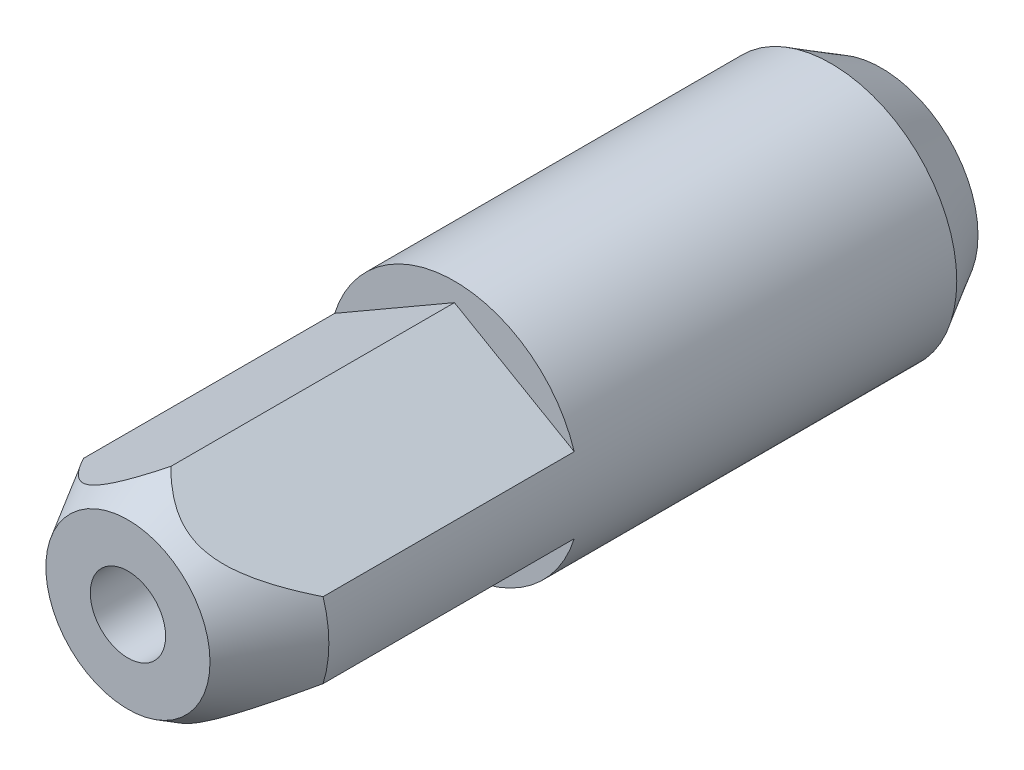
ISO-10303-21;
HEADER;
FILE_DESCRIPTION(('STEP AP214'),'2;1');
FILE_NAME('part.step','',(''),(''),'','','');
FILE_SCHEMA(('AUTOMOTIVE_DESIGN { 1 0 10303 214 1 1 1 1 }'));
ENDSEC;
DATA;
#1=APPLICATION_CONTEXT('core data for automotive mechanical design processes');
#2=APPLICATION_PROTOCOL_DEFINITION('international standard','automotive_design',2000,#1);
#3=PRODUCT_CONTEXT('',#1,'mechanical');
#4=PRODUCT('Part','Part','',(#3));
#5=PRODUCT_RELATED_PRODUCT_CATEGORY('part','',(#4));
#6=PRODUCT_DEFINITION_FORMATION('','',#4);
#7=PRODUCT_DEFINITION_CONTEXT('part definition',#1,'design');
#8=PRODUCT_DEFINITION('design','',#6,#7);
#9=PRODUCT_DEFINITION_SHAPE('','',#8);
#10=(LENGTH_UNIT() NAMED_UNIT(*) SI_UNIT(.MILLI.,.METRE.));
#11=(NAMED_UNIT(*) PLANE_ANGLE_UNIT() SI_UNIT($,.RADIAN.));
#12=(NAMED_UNIT(*) SI_UNIT($,.STERADIAN.) SOLID_ANGLE_UNIT());
#13=UNCERTAINTY_MEASURE_WITH_UNIT(LENGTH_MEASURE(1.E-05),#10,'distance_accuracy_value','');
#14=(GEOMETRIC_REPRESENTATION_CONTEXT(3) GLOBAL_UNCERTAINTY_ASSIGNED_CONTEXT((#13)) GLOBAL_UNIT_ASSIGNED_CONTEXT((#10,
#11,#12)) REPRESENTATION_CONTEXT('',''));
#15=CARTESIAN_POINT('',(0.,0.,0.));
#16=DIRECTION('',(0.,0.,1.));
#17=DIRECTION('',(1.,0.,0.));
#18=AXIS2_PLACEMENT_3D('',#15,#16,#17);
#19=CARTESIAN_POINT('',(0.,0.,27.));
#20=DIRECTION('',(0.,0.,-1.));
#21=DIRECTION('',(-1.,0.,0.));
#22=AXIS2_PLACEMENT_3D('',#19,#20,#21);
#23=CONICAL_SURFACE('',#22,5.,0.523598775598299);
#24=CARTESIAN_POINT('',(0.,0.,30.));
#25=DIRECTION('',(0.,0.,1.));
#26=DIRECTION('',(1.,0.,0.));
#27=AXIS2_PLACEMENT_3D('',#24,#25,#26);
#28=CIRCLE('',#27,3.26794919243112);
#29=CARTESIAN_POINT('',(3.26794919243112,0.,30.));
#30=VERTEX_POINT('',#29);
#31=EDGE_CURVE('E23',#30,#30,#28,.T.);
#32=ORIENTED_EDGE('',*,*,#31,.F.);
#33=EDGE_LOOP('',(#32));
#34=FACE_BOUND('',#33,.T.);
#35=CARTESIAN_POINT('',(-0.000200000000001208,4.2539007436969,28.2922818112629));
#36=CARTESIAN_POINT('',(0.038323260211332,4.23165932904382,28.3308045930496));
#37=CARTESIAN_POINT('',(0.0772314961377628,4.209195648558,28.3688138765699));
#38=CARTESIAN_POINT('',(0.155900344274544,4.16377616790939,28.4436611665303));
#39=CARTESIAN_POINT('',(0.195661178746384,4.14082023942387,28.4804988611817));
#40=CARTESIAN_POINT('',(0.316725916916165,4.07092348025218,28.589376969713));
#41=CARTESIAN_POINT('',(0.399420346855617,4.02317982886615,28.6593859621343));
#42=CARTESIAN_POINT('',(0.57129349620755,3.92394881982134,28.7939882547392));
#43=CARTESIAN_POINT('',(0.660585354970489,3.87239614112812,28.8583915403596));
#44=CARTESIAN_POINT('',(0.843945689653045,3.76653300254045,28.9769188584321));
#45=CARTESIAN_POINT('',(0.938003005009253,3.71222898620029,29.0310656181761));
#46=CARTESIAN_POINT('',(1.13976873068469,3.59573949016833,29.130020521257));
#47=CARTESIAN_POINT('',(1.24795131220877,3.53328024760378,29.1735958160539));
#48=CARTESIAN_POINT('',(1.41329415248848,3.4378195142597,29.2231593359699));
#49=CARTESIAN_POINT('',(1.4687166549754,3.40582131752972,29.237025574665));
#50=CARTESIAN_POINT('',(1.58038760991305,3.34134806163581,29.2591308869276));
#51=CARTESIAN_POINT('',(1.63663566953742,3.30887322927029,29.2673725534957));
#52=CARTESIAN_POINT('',(1.75009913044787,3.24336506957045,29.2779487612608));
#53=CARTESIAN_POINT('',(1.80731862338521,3.21032937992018,29.2802252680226));
#54=CARTESIAN_POINT('',(1.92169033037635,3.14429684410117,29.2786078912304));
#55=CARTESIAN_POINT('',(1.978842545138,3.11129999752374,29.2747140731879));
#56=CARTESIAN_POINT('',(2.09268403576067,3.0455735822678,29.2609098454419));
#57=CARTESIAN_POINT('',(2.14937247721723,3.01284449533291,29.2509903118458));
#58=CARTESIAN_POINT('',(2.26180709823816,2.94793033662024,29.2255298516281));
#59=CARTESIAN_POINT('',(2.31755268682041,2.91574560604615,29.2099855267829));
#60=CARTESIAN_POINT('',(2.51435885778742,2.80211951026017,29.1453717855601));
#61=CARTESIAN_POINT('',(2.65199836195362,2.72265330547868,29.0819760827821));
#62=CARTESIAN_POINT('',(2.8511276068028,2.60768598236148,28.9691954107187));
#63=CARTESIAN_POINT('',(2.91659762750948,2.56988684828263,28.9283995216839));
#64=CARTESIAN_POINT('',(3.04511090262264,2.49568967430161,28.8419756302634));
#65=CARTESIAN_POINT('',(3.10815476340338,2.45929128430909,28.796348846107));
#66=CARTESIAN_POINT('',(3.24864013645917,2.37818201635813,28.6883723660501));
#67=CARTESIAN_POINT('',(3.32538626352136,2.33387261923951,28.6248283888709));
#68=CARTESIAN_POINT('',(3.47569375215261,2.24709255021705,28.4928703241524));
#69=CARTESIAN_POINT('',(3.54925377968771,2.20462264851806,28.4244542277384));
#70=CARTESIAN_POINT('',(3.69378588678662,2.12117699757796,28.28364479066));
#71=CARTESIAN_POINT('',(3.76475040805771,2.08020561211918,28.2112411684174));
#72=CARTESIAN_POINT('',(3.90428118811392,1.99964747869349,28.0634123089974));
#73=CARTESIAN_POINT('',(3.97284718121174,1.96006088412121,27.9879867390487));
#74=CARTESIAN_POINT('',(4.10451079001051,1.88404486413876,27.8385692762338));
#75=CARTESIAN_POINT('',(4.16770996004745,1.84755680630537,27.7646962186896));
#76=CARTESIAN_POINT('',(4.29248993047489,1.77551505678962,27.6151438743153));
#77=CARTESIAN_POINT('',(4.35407061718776,1.73996143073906,27.5394644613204));
#78=CARTESIAN_POINT('',(4.47539394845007,1.66991537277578,27.3871388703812));
#79=CARTESIAN_POINT('',(4.53514639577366,1.63541728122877,27.3105030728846));
#80=CARTESIAN_POINT('',(4.65340823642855,1.5671387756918,27.1559934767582));
#81=CARTESIAN_POINT('',(4.71191791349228,1.53335819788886,27.0781199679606));
#82=CARTESIAN_POINT('',(4.76989600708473,1.49988452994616,26.9997295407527));
#83=B_SPLINE_CURVE_WITH_KNOTS('',3,(#35,#36,#37,#38,#39,#40,#41,#42,#43,#44,#45,#46,#47,#48,#49,
#50,#51,#52,#53,#54,#55,#56,#57,#58,#59,#60,#61,#62,#63,#64,#65,#66,#67,#68,#69,#70,#71,#72,#73,
#74,#75,#76,#77,#78,#79,#80,#81,#82),.UNSPECIFIED.,.F.,.F.,(4,2,2,2,2,2,2,2,2,2,2,2,2,2,2,2,2,2,
2,2,2,2,2,4),(0.,0.176528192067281,0.353102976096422,0.708054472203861,1.07230829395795,
1.4357452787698,1.83100537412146,2.02723914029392,2.22338237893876,2.4214269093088,
2.61946933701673,2.81781238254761,3.01627545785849,3.52623333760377,3.78385768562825,
4.04141722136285,4.36834511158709,4.69540859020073,5.02335892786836,5.3513454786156,
5.66282813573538,5.97433261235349,6.28367121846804,6.59293842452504),.UNSPECIFIED.);
#84=CARTESIAN_POINT('',(0.,4.25378527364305,28.2924818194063));
#85=VERTEX_POINT('',#84);
#86=CARTESIAN_POINT('',(4.76969600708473,1.5,27.));
#87=VERTEX_POINT('',#86);
#88=EDGE_CURVE('E102',#85,#87,#83,.T.);
#89=ORIENTED_EDGE('',*,*,#88,.F.);
#90=CARTESIAN_POINT('',(0.000199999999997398,4.2539007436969,28.2922818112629));
#91=CARTESIAN_POINT('',(-0.0383232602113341,4.23165932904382,28.3308045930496));
#92=CARTESIAN_POINT('',(-0.0772314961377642,4.209195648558,28.3688138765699));
#93=CARTESIAN_POINT('',(-0.155900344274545,4.16377616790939,28.4436611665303));
#94=CARTESIAN_POINT('',(-0.195661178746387,4.14082023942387,28.4804988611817));
#95=CARTESIAN_POINT('',(-0.316725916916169,4.07092348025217,28.589376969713));
#96=CARTESIAN_POINT('',(-0.399420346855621,4.02317982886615,28.6593859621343));
#97=CARTESIAN_POINT('',(-0.571293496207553,3.92394881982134,28.7939882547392));
#98=CARTESIAN_POINT('',(-0.660585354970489,3.87239614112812,28.8583915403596));
#99=CARTESIAN_POINT('',(-0.843945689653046,3.76653300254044,28.9769188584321));
#100=CARTESIAN_POINT('',(-0.938003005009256,3.71222898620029,29.0310656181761));
#101=CARTESIAN_POINT('',(-1.13976873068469,3.59573949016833,29.130020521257));
#102=CARTESIAN_POINT('',(-1.24795131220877,3.53328024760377,29.1735958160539));
#103=CARTESIAN_POINT('',(-1.41329415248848,3.4378195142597,29.2231593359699));
#104=CARTESIAN_POINT('',(-1.4687166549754,3.40582131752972,29.237025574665));
#105=CARTESIAN_POINT('',(-1.58038760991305,3.34134806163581,29.2591308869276));
#106=CARTESIAN_POINT('',(-1.63663566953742,3.30887322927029,29.2673725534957));
#107=CARTESIAN_POINT('',(-1.75009913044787,3.24336506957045,29.2779487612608));
#108=CARTESIAN_POINT('',(-1.80731862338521,3.21032937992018,29.2802252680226));
#109=CARTESIAN_POINT('',(-1.92169033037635,3.14429684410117,29.2786078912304));
#110=CARTESIAN_POINT('',(-1.97884254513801,3.11129999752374,29.2747140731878));
#111=CARTESIAN_POINT('',(-2.09268403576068,3.04557358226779,29.2609098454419));
#112=CARTESIAN_POINT('',(-2.14937247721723,3.01284449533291,29.2509903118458));
#113=CARTESIAN_POINT('',(-2.26180709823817,2.94793033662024,29.2255298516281));
#114=CARTESIAN_POINT('',(-2.31755268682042,2.91574560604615,29.2099855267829));
#115=CARTESIAN_POINT('',(-2.51435885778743,2.80211951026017,29.1453717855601));
#116=CARTESIAN_POINT('',(-2.65199836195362,2.72265330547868,29.0819760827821));
#117=CARTESIAN_POINT('',(-2.8511276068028,2.60768598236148,28.9691954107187));
#118=CARTESIAN_POINT('',(-2.91659762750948,2.56988684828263,28.9283995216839));
#119=CARTESIAN_POINT('',(-3.04511090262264,2.49568967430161,28.8419756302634));
#120=CARTESIAN_POINT('',(-3.10815476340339,2.45929128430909,28.796348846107));
#121=CARTESIAN_POINT('',(-3.24864013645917,2.37818201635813,28.6883723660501));
#122=CARTESIAN_POINT('',(-3.32538626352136,2.33387261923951,28.6248283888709));
#123=CARTESIAN_POINT('',(-3.47569375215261,2.24709255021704,28.4928703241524));
#124=CARTESIAN_POINT('',(-3.54925377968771,2.20462264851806,28.4244542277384));
#125=CARTESIAN_POINT('',(-3.69378588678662,2.12117699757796,28.28364479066));
#126=CARTESIAN_POINT('',(-3.76475040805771,2.08020561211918,28.2112411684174));
#127=CARTESIAN_POINT('',(-3.90428118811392,1.99964747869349,28.0634123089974));
#128=CARTESIAN_POINT('',(-3.97284718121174,1.96006088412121,27.9879867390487));
#129=CARTESIAN_POINT('',(-4.10451079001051,1.88404486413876,27.8385692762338));
#130=CARTESIAN_POINT('',(-4.16770996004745,1.84755680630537,27.7646962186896));
#131=CARTESIAN_POINT('',(-4.29248993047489,1.77551505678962,27.6151438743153));
#132=CARTESIAN_POINT('',(-4.35407061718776,1.73996143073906,27.5394644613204));
#133=CARTESIAN_POINT('',(-4.47539394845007,1.66991537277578,27.3871388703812));
#134=CARTESIAN_POINT('',(-4.53514639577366,1.63541728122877,27.3105030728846));
#135=CARTESIAN_POINT('',(-4.65340823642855,1.5671387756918,27.1559934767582));
#136=CARTESIAN_POINT('',(-4.71191791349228,1.53335819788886,27.0781199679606));
#137=CARTESIAN_POINT('',(-4.76989600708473,1.49988452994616,26.9997295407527));
#138=B_SPLINE_CURVE_WITH_KNOTS('',3,(#90,#91,#92,#93,#94,#95,#96,#97,#98,#99,#100,#101,#102,
#103,#104,#105,#106,#107,#108,#109,#110,#111,#112,#113,#114,#115,#116,#117,#118,#119,#120,#121,
#122,#123,#124,#125,#126,#127,#128,#129,#130,#131,#132,#133,#134,#135,#136,#137),.UNSPECIFIED.,
.F.,.F.,(4,2,2,2,2,2,2,2,2,2,2,2,2,2,2,2,2,2,2,2,2,2,2,4),(0.,0.176528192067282,
0.353102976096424,0.708054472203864,1.07230829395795,1.4357452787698,1.83100537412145,
2.02723914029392,2.22338237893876,2.42142690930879,2.61946933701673,2.81781238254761,
3.0162754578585,3.52623333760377,3.78385768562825,4.04141722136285,4.36834511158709,
4.69540859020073,5.02335892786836,5.3513454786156,5.66282813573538,5.97433261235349,
6.28367121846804,6.59293842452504),.UNSPECIFIED.);
#139=CARTESIAN_POINT('',(-4.76969600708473,1.5,27.));
#140=VERTEX_POINT('',#139);
#141=EDGE_CURVE('E75',#85,#140,#138,.T.);
#142=ORIENTED_EDGE('',*,*,#141,.T.);
#143=CARTESIAN_POINT('',(0.,0.,27.));
#144=DIRECTION('',(0.,0.,1.));
#145=DIRECTION('',(1.,0.,0.));
#146=AXIS2_PLACEMENT_3D('',#143,#144,#145);
#147=CIRCLE('',#146,5.);
#148=CARTESIAN_POINT('',(-4.76969600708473,-1.5,27.));
#149=VERTEX_POINT('',#148);
#150=EDGE_CURVE('E155',#140,#149,#147,.T.);
#151=ORIENTED_EDGE('',*,*,#150,.T.);
#152=CARTESIAN_POINT('',(0.0001999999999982,-4.25390074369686,28.292281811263));
#153=CARTESIAN_POINT('',(-0.0383232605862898,-4.23165932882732,28.3308045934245));
#154=CARTESIAN_POINT('',(-0.0772314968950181,-4.20919564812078,28.3688138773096));
#155=CARTESIAN_POINT('',(-0.155900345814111,-4.16377616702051,28.4436611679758));
#156=CARTESIAN_POINT('',(-0.195661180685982,-4.14082023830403,28.4804988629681));
#157=CARTESIAN_POINT('',(-0.31672592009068,-4.07092347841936,28.5893769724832));
#158=CARTESIAN_POINT('',(-0.399420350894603,-4.02317982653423,28.6593859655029));
#159=CARTESIAN_POINT('',(-0.571293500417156,-3.92394881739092,28.7939882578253));
#160=CARTESIAN_POINT('',(-0.66058535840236,-3.87239613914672,28.858391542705));
#161=CARTESIAN_POINT('',(-0.84394569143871,-3.76653300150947,28.9769188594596));
#162=CARTESIAN_POINT('',(-0.938003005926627,-3.71222898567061,29.0310656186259));
#163=CARTESIAN_POINT('',(-1.13976873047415,-3.59573949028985,29.130020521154));
#164=CARTESIAN_POINT('',(-1.2479513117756,-3.53328024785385,29.1735958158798));
#165=CARTESIAN_POINT('',(-1.41329415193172,-3.43781951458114,29.2231593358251));
#166=CARTESIAN_POINT('',(-1.46871665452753,-3.40582131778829,29.2370255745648));
#167=CARTESIAN_POINT('',(-1.58038760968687,-3.34134806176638,29.2591308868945));
#168=CARTESIAN_POINT('',(-1.63663566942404,-3.30887322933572,29.2673725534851));
#169=CARTESIAN_POINT('',(-1.75009913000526,-3.24336506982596,29.2779487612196));
#170=CARTESIAN_POINT('',(-1.80731862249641,-3.21032938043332,29.2802252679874));
#171=CARTESIAN_POINT('',(-1.92169032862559,-3.14429684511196,29.2786078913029));
#172=CARTESIAN_POINT('',(-1.97884254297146,-3.11129999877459,29.2747140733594));
#173=CARTESIAN_POINT('',(-2.09268403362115,-3.04557358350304,29.2609098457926));
#174=CARTESIAN_POINT('',(-2.1493724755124,-3.01284449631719,29.2509903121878));
#175=CARTESIAN_POINT('',(-2.26180709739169,-2.94793033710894,29.2255298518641));
#176=CARTESIAN_POINT('',(-2.3175526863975,-2.9157456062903,29.2099855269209));
#177=CARTESIAN_POINT('',(-2.51435886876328,-2.80211950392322,29.1453717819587));
#178=CARTESIAN_POINT('',(-2.65199838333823,-2.72265329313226,29.0819760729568));
#179=CARTESIAN_POINT('',(-2.85112763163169,-2.60768596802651,28.9691953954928));
#180=CARTESIAN_POINT('',(-2.9165976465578,-2.56988683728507,28.9283995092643));
#181=CARTESIAN_POINT('',(-3.04511091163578,-2.49568966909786,28.8419756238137));
#182=CARTESIAN_POINT('',(-3.10815476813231,-2.45929128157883,28.7963488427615));
#183=CARTESIAN_POINT('',(-3.24863718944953,-2.37818371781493,28.6883746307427));
#184=CARTESIAN_POINT('',(-3.32538050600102,-2.33387594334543,28.6248331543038));
#185=CARTESIAN_POINT('',(-3.47568259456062,-2.24709899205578,28.4928804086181));
#186=CARTESIAN_POINT('',(-3.54924003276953,-2.20463058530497,28.4244671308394));
#187=CARTESIAN_POINT('',(-3.69376711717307,-2.12118783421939,28.2836635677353));
#188=CARTESIAN_POINT('',(-3.76472920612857,-2.08021785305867,28.2112630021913));
#189=CARTESIAN_POINT('',(-3.90425526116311,-1.99966244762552,28.0634404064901));
#190=CARTESIAN_POINT('',(-3.97281896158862,-1.96007717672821,27.9880180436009));
#191=CARTESIAN_POINT('',(-4.10447837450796,-1.88406357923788,27.8386067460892));
#192=CARTESIAN_POINT('',(-4.16767563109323,-1.84757662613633,27.7647366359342));
#193=CARTESIAN_POINT('',(-4.29245184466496,-1.77553704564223,27.6151902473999));
#194=CARTESIAN_POINT('',(-4.35403068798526,-1.73998448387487,27.5395138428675));
#195=CARTESIAN_POINT('',(-4.47535043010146,-1.66994049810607,27.3871942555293));
#196=CARTESIAN_POINT('',(-4.53510113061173,-1.63544341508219,27.3105614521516));
#197=CARTESIAN_POINT('',(-4.65335952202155,-1.56716690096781,27.156057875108));
#198=CARTESIAN_POINT('',(-4.7118674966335,-1.53338730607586,27.0781873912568));
#199=CARTESIAN_POINT('',(-4.76984390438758,-1.49991461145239,26.9998));
#200=B_SPLINE_CURVE_WITH_KNOTS('',3,(#152,#153,#154,#155,#156,#157,#158,#159,#160,#161,#162,
#163,#164,#165,#166,#167,#168,#169,#170,#171,#172,#173,#174,#175,#176,#177,#178,#179,#180,#181,
#182,#183,#184,#185,#186,#187,#188,#189,#190,#191,#192,#193,#194,#195,#196,#197,#198,#199),
.UNSPECIFIED.,.F.,.F.,(4,2,2,2,2,2,2,2,2,2,2,2,2,2,2,2,2,2,2,2,2,2,2,4),(0.,0.176528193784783,
0.353102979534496,0.708054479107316,1.07230829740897,1.43574527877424,1.83100537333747,
2.02723913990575,2.22338237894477,2.42142690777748,2.61946933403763,2.81781238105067,
3.01627545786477,3.52623337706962,3.78385770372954,4.04141722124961,4.36833285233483,
4.69538405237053,5.02332201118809,5.35129617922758,5.66276788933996,5.97426141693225,
6.28358929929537,6.59284578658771),.UNSPECIFIED.);
#201=CARTESIAN_POINT('',(0.,-4.25378527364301,28.2924818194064));
#202=VERTEX_POINT('',#201);
#203=EDGE_CURVE('E129',#202,#149,#200,.T.);
#204=ORIENTED_EDGE('',*,*,#203,.F.);
#205=CARTESIAN_POINT('',(-0.000200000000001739,-4.25390074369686,28.292281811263));
#206=CARTESIAN_POINT('',(0.0383232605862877,-4.23165932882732,28.3308045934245));
#207=CARTESIAN_POINT('',(0.0772314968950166,-4.20919564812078,28.3688138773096));
#208=CARTESIAN_POINT('',(0.155900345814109,-4.16377616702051,28.4436611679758));
#209=CARTESIAN_POINT('',(0.195661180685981,-4.14082023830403,28.4804988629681));
#210=CARTESIAN_POINT('',(0.316725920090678,-4.07092347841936,28.5893769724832));
#211=CARTESIAN_POINT('',(0.399420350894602,-4.02317982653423,28.6593859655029));
#212=CARTESIAN_POINT('',(0.571293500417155,-3.92394881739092,28.7939882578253));
#213=CARTESIAN_POINT('',(0.660585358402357,-3.87239613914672,28.858391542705));
#214=CARTESIAN_POINT('',(0.843945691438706,-3.76653300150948,28.9769188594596));
#215=CARTESIAN_POINT('',(0.938003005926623,-3.71222898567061,29.0310656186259));
#216=CARTESIAN_POINT('',(1.13976873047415,-3.59573949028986,29.130020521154));
#217=CARTESIAN_POINT('',(1.24795131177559,-3.53328024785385,29.1735958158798));
#218=CARTESIAN_POINT('',(1.41329415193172,-3.43781951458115,29.2231593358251));
#219=CARTESIAN_POINT('',(1.46871665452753,-3.40582131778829,29.2370255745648));
#220=CARTESIAN_POINT('',(1.58038760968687,-3.34134806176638,29.2591308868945));
#221=CARTESIAN_POINT('',(1.63663566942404,-3.30887322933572,29.2673725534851));
#222=CARTESIAN_POINT('',(1.75009913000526,-3.24336506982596,29.2779487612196));
#223=CARTESIAN_POINT('',(1.80731862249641,-3.21032938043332,29.2802252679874));
#224=CARTESIAN_POINT('',(1.92169032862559,-3.14429684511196,29.2786078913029));
#225=CARTESIAN_POINT('',(1.97884254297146,-3.11129999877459,29.2747140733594));
#226=CARTESIAN_POINT('',(2.09268403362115,-3.04557358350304,29.2609098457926));
#227=CARTESIAN_POINT('',(2.1493724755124,-3.01284449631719,29.2509903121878));
#228=CARTESIAN_POINT('',(2.2618070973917,-2.94793033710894,29.2255298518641));
#229=CARTESIAN_POINT('',(2.3175526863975,-2.9157456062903,29.209985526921));
#230=CARTESIAN_POINT('',(2.51435886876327,-2.80211950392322,29.1453717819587));
#231=CARTESIAN_POINT('',(2.65199838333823,-2.72265329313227,29.0819760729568));
#232=CARTESIAN_POINT('',(2.85112763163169,-2.60768596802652,28.9691953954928));
#233=CARTESIAN_POINT('',(2.9165976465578,-2.56988683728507,28.9283995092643));
#234=CARTESIAN_POINT('',(3.04511091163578,-2.49568966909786,28.8419756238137));
#235=CARTESIAN_POINT('',(3.10815476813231,-2.45929128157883,28.7963488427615));
#236=CARTESIAN_POINT('',(3.24863718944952,-2.37818371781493,28.6883746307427));
#237=CARTESIAN_POINT('',(3.32538050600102,-2.33387594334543,28.6248331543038));
#238=CARTESIAN_POINT('',(3.47568259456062,-2.24709899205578,28.4928804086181));
#239=CARTESIAN_POINT('',(3.54924003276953,-2.20463058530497,28.4244671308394));
#240=CARTESIAN_POINT('',(3.69376711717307,-2.12118783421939,28.2836635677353));
#241=CARTESIAN_POINT('',(3.76472920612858,-2.08021785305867,28.2112630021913));
#242=CARTESIAN_POINT('',(3.90425526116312,-1.99966244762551,28.0634404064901));
#243=CARTESIAN_POINT('',(3.97281896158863,-1.96007717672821,27.9880180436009));
#244=CARTESIAN_POINT('',(4.10447837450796,-1.88406357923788,27.8386067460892));
#245=CARTESIAN_POINT('',(4.16767563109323,-1.84757662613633,27.7647366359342));
#246=CARTESIAN_POINT('',(4.29245184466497,-1.77553704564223,27.6151902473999));
#247=CARTESIAN_POINT('',(4.35403068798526,-1.73998448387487,27.5395138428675));
#248=CARTESIAN_POINT('',(4.47535043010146,-1.66994049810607,27.3871942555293));
#249=CARTESIAN_POINT('',(4.53510113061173,-1.63544341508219,27.3105614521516));
#250=CARTESIAN_POINT('',(4.65335952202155,-1.56716690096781,27.156057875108));
#251=CARTESIAN_POINT('',(4.7118674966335,-1.53338730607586,27.0781873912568));
#252=CARTESIAN_POINT('',(4.76984390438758,-1.49991461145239,26.9998));
#253=B_SPLINE_CURVE_WITH_KNOTS('',3,(#205,#206,#207,#208,#209,#210,#211,#212,#213,#214,#215,
#216,#217,#218,#219,#220,#221,#222,#223,#224,#225,#226,#227,#228,#229,#230,#231,#232,#233,#234,
#235,#236,#237,#238,#239,#240,#241,#242,#243,#244,#245,#246,#247,#248,#249,#250,#251,#252),
.UNSPECIFIED.,.F.,.F.,(4,2,2,2,2,2,2,2,2,2,2,2,2,2,2,2,2,2,2,2,2,2,2,4),(0.,0.176528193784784,
0.353102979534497,0.708054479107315,1.07230829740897,1.43574527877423,1.83100537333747,
2.02723913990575,2.22338237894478,2.42142690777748,2.61946933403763,2.81781238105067,
3.01627545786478,3.52623337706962,3.78385770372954,4.04141722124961,4.36833285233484,
4.69538405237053,5.0233220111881,5.35129617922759,5.66276788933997,5.97426141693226,
6.28358929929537,6.59284578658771),.UNSPECIFIED.);
#254=CARTESIAN_POINT('',(4.76969600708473,-1.5,27.));
#255=VERTEX_POINT('',#254);
#256=EDGE_CURVE('E138',#202,#255,#253,.T.);
#257=ORIENTED_EDGE('',*,*,#256,.T.);
#258=EDGE_CURVE('E156',#255,#87,#147,.T.);
#259=ORIENTED_EDGE('',*,*,#258,.T.);
#260=EDGE_LOOP('',(#89,#142,#151,#204,#257,#259));
#261=FACE_BOUND('',#260,.T.);
#262=ADVANCED_FACE('F15',(#34,#261),#23,.T.);
#263=CARTESIAN_POINT('',(0.,0.,30.));
#264=DIRECTION('',(0.,0.,1.));
#265=DIRECTION('',(1.,0.,0.));
#266=AXIS2_PLACEMENT_3D('',#263,#264,#265);
#267=CYLINDRICAL_SURFACE('',#266,5.);
#268=CARTESIAN_POINT('',(0.,0.,2.));
#269=DIRECTION('',(0.,0.,1.));
#270=DIRECTION('',(1.,0.,0.));
#271=AXIS2_PLACEMENT_3D('',#268,#269,#270);
#272=CIRCLE('',#271,5.);
#273=CARTESIAN_POINT('',(5.,0.,2.));
#274=VERTEX_POINT('',#273);
#275=EDGE_CURVE('E152',#274,#274,#272,.T.);
#276=ORIENTED_EDGE('',*,*,#275,.T.);
#277=EDGE_LOOP('',(#276));
#278=FACE_BOUND('',#277,.T.);
#279=DIRECTION('',(0.,0.,1.));
#280=VECTOR('',#279,1.);
#281=CARTESIAN_POINT('',(4.76969600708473,1.5,17.));
#282=LINE('',#281,#280);
#283=CARTESIAN_POINT('',(4.76969600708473,1.5,17.));
#284=VERTEX_POINT('',#283);
#285=EDGE_CURVE('E82',#284,#87,#282,.T.);
#286=ORIENTED_EDGE('',*,*,#285,.T.);
#287=ORIENTED_EDGE('',*,*,#258,.F.);
#288=DIRECTION('',(0.,0.,1.));
#289=VECTOR('',#288,1.);
#290=CARTESIAN_POINT('',(4.76969600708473,-1.5,17.));
#291=LINE('',#290,#289);
#292=CARTESIAN_POINT('',(4.76969600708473,-1.5,17.));
#293=VERTEX_POINT('',#292);
#294=EDGE_CURVE('E179',#293,#255,#291,.T.);
#295=ORIENTED_EDGE('',*,*,#294,.F.);
#296=CARTESIAN_POINT('',(0.,0.,17.));
#297=DIRECTION('',(0.,0.,1.));
#298=DIRECTION('',(1.,0.,0.));
#299=AXIS2_PLACEMENT_3D('',#296,#297,#298);
#300=CIRCLE('',#299,5.);
#301=CARTESIAN_POINT('',(-4.76969600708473,-1.5,17.));
#302=VERTEX_POINT('',#301);
#303=EDGE_CURVE('E169',#302,#293,#300,.T.);
#304=ORIENTED_EDGE('',*,*,#303,.F.);
#305=DIRECTION('',(0.,0.,1.));
#306=VECTOR('',#305,1.);
#307=CARTESIAN_POINT('',(-4.76969600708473,-1.5,17.));
#308=LINE('',#307,#306);
#309=EDGE_CURVE('E176',#302,#149,#308,.T.);
#310=ORIENTED_EDGE('',*,*,#309,.T.);
#311=ORIENTED_EDGE('',*,*,#150,.F.);
#312=DIRECTION('',(0.,0.,1.));
#313=VECTOR('',#312,1.);
#314=CARTESIAN_POINT('',(-4.76969600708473,1.5,17.));
#315=LINE('',#314,#313);
#316=CARTESIAN_POINT('',(-4.76969600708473,1.5,17.));
#317=VERTEX_POINT('',#316);
#318=EDGE_CURVE('E78',#317,#140,#315,.T.);
#319=ORIENTED_EDGE('',*,*,#318,.F.);
#320=CARTESIAN_POINT('',(0.,0.,17.));
#321=DIRECTION('',(0.,0.,1.));
#322=DIRECTION('',(1.,0.,0.));
#323=AXIS2_PLACEMENT_3D('',#320,#321,#322);
#324=CIRCLE('',#323,5.);
#325=EDGE_CURVE('E86',#284,#317,#324,.T.);
#326=ORIENTED_EDGE('',*,*,#325,.F.);
#327=EDGE_LOOP('',(#286,#287,#295,#304,#310,#311,#319,#326));
#328=FACE_BOUND('',#327,.T.);
#329=ADVANCED_FACE('F165',(#278,#328),#267,.T.);
#330=CARTESIAN_POINT('',(0.,0.,30.));
#331=DIRECTION('',(0.,0.,1.));
#332=DIRECTION('',(1.,0.,0.));
#333=AXIS2_PLACEMENT_3D('',#330,#331,#332);
#334=CYLINDRICAL_SURFACE('',#333,1.5);
#335=CARTESIAN_POINT('',(0.,0.,24.));
#336=DIRECTION('',(0.,0.,1.));
#337=DIRECTION('',(1.,0.,0.));
#338=AXIS2_PLACEMENT_3D('',#335,#336,#337);
#339=CIRCLE('',#338,1.5);
#340=CARTESIAN_POINT('',(1.5,0.,24.));
#341=VERTEX_POINT('',#340);
#342=EDGE_CURVE('E89',#341,#341,#339,.T.);
#343=ORIENTED_EDGE('',*,*,#342,.F.);
#344=EDGE_LOOP('',(#343));
#345=FACE_BOUND('',#344,.T.);
#346=CARTESIAN_POINT('',(0.,0.,30.));
#347=DIRECTION('',(0.,0.,1.));
#348=DIRECTION('',(1.,0.,0.));
#349=AXIS2_PLACEMENT_3D('',#346,#347,#348);
#350=CIRCLE('',#349,1.5);
#351=CARTESIAN_POINT('',(1.5,0.,30.));
#352=VERTEX_POINT('',#351);
#353=EDGE_CURVE('E9',#352,#352,#350,.T.);
#354=ORIENTED_EDGE('',*,*,#353,.T.);
#355=EDGE_LOOP('',(#354));
#356=FACE_BOUND('',#355,.T.);
#357=ADVANCED_FACE('F17',(#345,#356),#334,.F.);
#358=CARTESIAN_POINT('',(3.26794919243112,0.,30.));
#359=DIRECTION('',(0.,0.,-1.));
#360=DIRECTION('',(-1.,0.,0.));
#361=AXIS2_PLACEMENT_3D('',#358,#359,#360);
#362=PLANE('',#361);
#363=ORIENTED_EDGE('',*,*,#353,.F.);
#364=EDGE_LOOP('',(#363));
#365=FACE_BOUND('',#364,.T.);
#366=ORIENTED_EDGE('',*,*,#31,.T.);
#367=EDGE_LOOP('',(#366));
#368=FACE_BOUND('',#367,.T.);
#369=ADVANCED_FACE('F161',(#365,#368),#362,.F.);
#370=CARTESIAN_POINT('',(0.,0.,0.));
#371=DIRECTION('',(0.,0.,1.));
#372=DIRECTION('',(1.,0.,0.));
#373=AXIS2_PLACEMENT_3D('',#370,#371,#372);
#374=CONICAL_SURFACE('',#373,3.84529946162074,0.523598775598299);
#375=ORIENTED_EDGE('',*,*,#275,.F.);
#376=EDGE_LOOP('',(#375));
#377=FACE_BOUND('',#376,.T.);
#378=CARTESIAN_POINT('',(0.,0.,0.));
#379=DIRECTION('',(0.,0.,1.));
#380=DIRECTION('',(1.,0.,0.));
#381=AXIS2_PLACEMENT_3D('',#378,#379,#380);
#382=CIRCLE('',#381,3.84529946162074);
#383=CARTESIAN_POINT('',(3.84529946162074,0.,0.));
#384=VERTEX_POINT('',#383);
#385=EDGE_CURVE('E149',#384,#384,#382,.T.);
#386=ORIENTED_EDGE('',*,*,#385,.T.);
#387=EDGE_LOOP('',(#386));
#388=FACE_BOUND('',#387,.T.);
#389=ADVANCED_FACE('F252',(#377,#388),#374,.T.);
#390=CARTESIAN_POINT('',(1.,0.,0.));
#391=DIRECTION('',(0.,0.,1.));
#392=DIRECTION('',(1.,0.,0.));
#393=AXIS2_PLACEMENT_3D('',#390,#391,#392);
#394=PLANE('',#393);
#395=ORIENTED_EDGE('',*,*,#385,.F.);
#396=EDGE_LOOP('',(#395));
#397=FACE_BOUND('',#396,.T.);
#398=CARTESIAN_POINT('',(0.,0.,0.));
#399=DIRECTION('',(0.,0.,1.));
#400=DIRECTION('',(1.,0.,0.));
#401=AXIS2_PLACEMENT_3D('',#398,#399,#400);
#402=CIRCLE('',#401,1.);
#403=CARTESIAN_POINT('',(1.,0.,0.));
#404=VERTEX_POINT('',#403);
#405=EDGE_CURVE('E146',#404,#404,#402,.T.);
#406=ORIENTED_EDGE('',*,*,#405,.T.);
#407=EDGE_LOOP('',(#406));
#408=FACE_BOUND('',#407,.T.);
#409=ADVANCED_FACE('F257',(#397,#408),#394,.F.);
#410=CARTESIAN_POINT('',(0.,0.,30.));
#411=DIRECTION('',(0.,0.,1.));
#412=DIRECTION('',(1.,0.,0.));
#413=AXIS2_PLACEMENT_3D('',#410,#411,#412);
#414=CYLINDRICAL_SURFACE('',#413,1.);
#415=ORIENTED_EDGE('',*,*,#405,.F.);
#416=EDGE_LOOP('',(#415));
#417=FACE_BOUND('',#416,.T.);
#418=CARTESIAN_POINT('',(0.,0.,4.));
#419=DIRECTION('',(0.,0.,1.));
#420=DIRECTION('',(1.,0.,0.));
#421=AXIS2_PLACEMENT_3D('',#418,#419,#420);
#422=CIRCLE('',#421,1.);
#423=CARTESIAN_POINT('',(1.,0.,4.));
#424=VERTEX_POINT('',#423);
#425=EDGE_CURVE('E137',#424,#424,#422,.T.);
#426=ORIENTED_EDGE('',*,*,#425,.T.);
#427=EDGE_LOOP('',(#426));
#428=FACE_BOUND('',#427,.T.);
#429=ADVANCED_FACE('F266',(#417,#428),#414,.F.);
#430=CARTESIAN_POINT('',(0.,0.,4.));
#431=DIRECTION('',(0.,0.,1.));
#432=DIRECTION('',(1.,0.,0.));
#433=AXIS2_PLACEMENT_3D('',#430,#431,#432);
#434=PLANE('',#433);
#435=ORIENTED_EDGE('',*,*,#425,.F.);
#436=EDGE_LOOP('',(#435));
#437=FACE_BOUND('',#436,.T.);
#438=ADVANCED_FACE('F124',(#437),#434,.F.);
#439=CARTESIAN_POINT('',(-4.76969600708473,-1.5,17.));
#440=DIRECTION('',(-0.5,-0.866025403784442,0.));
#441=DIRECTION('',(0.866025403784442,-0.5,0.));
#442=AXIS2_PLACEMENT_3D('',#439,#440,#441);
#443=PLANE('',#442);
#444=ORIENTED_EDGE('',*,*,#203,.T.);
#445=ORIENTED_EDGE('',*,*,#309,.F.);
#446=DIRECTION('',(0.866025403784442,-0.5,0.));
#447=VECTOR('',#446,1.);
#448=CARTESIAN_POINT('',(-4.76969600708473,-1.5,17.));
#449=LINE('',#448,#447);
#450=CARTESIAN_POINT('',(0.,-4.25378527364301,17.));
#451=VERTEX_POINT('',#450);
#452=EDGE_CURVE('E38',#302,#451,#449,.T.);
#453=ORIENTED_EDGE('',*,*,#452,.T.);
#454=DIRECTION('',(0.,0.,1.));
#455=VECTOR('',#454,1.);
#456=CARTESIAN_POINT('',(0.,-4.25378527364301,17.));
#457=LINE('',#456,#455);
#458=EDGE_CURVE('E180',#451,#202,#457,.T.);
#459=ORIENTED_EDGE('',*,*,#458,.T.);
#460=EDGE_LOOP('',(#444,#445,#453,#459));
#461=FACE_BOUND('',#460,.T.);
#462=ADVANCED_FACE('F120',(#461),#443,.T.);
#463=CARTESIAN_POINT('',(4.76969600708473,-1.5,17.));
#464=DIRECTION('',(-0.5,0.866025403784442,0.));
#465=DIRECTION('',(-0.866025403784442,-0.5,0.));
#466=AXIS2_PLACEMENT_3D('',#463,#464,#465);
#467=PLANE('',#466);
#468=ORIENTED_EDGE('',*,*,#458,.F.);
#469=DIRECTION('',(-0.866025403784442,-0.5,0.));
#470=VECTOR('',#469,1.);
#471=CARTESIAN_POINT('',(4.76969600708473,-1.5,17.));
#472=LINE('',#471,#470);
#473=EDGE_CURVE('E170',#293,#451,#472,.T.);
#474=ORIENTED_EDGE('',*,*,#473,.F.);
#475=ORIENTED_EDGE('',*,*,#294,.T.);
#476=ORIENTED_EDGE('',*,*,#256,.F.);
#477=EDGE_LOOP('',(#468,#474,#475,#476));
#478=FACE_BOUND('',#477,.T.);
#479=ADVANCED_FACE('F119',(#478),#467,.F.);
#480=CARTESIAN_POINT('',(0.,0.,17.));
#481=DIRECTION('',(0.,0.,1.));
#482=DIRECTION('',(1.,0.,0.));
#483=AXIS2_PLACEMENT_3D('',#480,#481,#482);
#484=PLANE('',#483);
#485=ORIENTED_EDGE('',*,*,#452,.F.);
#486=ORIENTED_EDGE('',*,*,#303,.T.);
#487=ORIENTED_EDGE('',*,*,#473,.T.);
#488=EDGE_LOOP('',(#485,#486,#487));
#489=FACE_BOUND('',#488,.T.);
#490=ADVANCED_FACE('F116',(#489),#484,.T.);
#491=CARTESIAN_POINT('',(4.76969600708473,1.5,17.));
#492=DIRECTION('',(0.5,0.866025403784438,0.));
#493=DIRECTION('',(-0.866025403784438,0.5,0.));
#494=AXIS2_PLACEMENT_3D('',#491,#492,#493);
#495=PLANE('',#494);
#496=ORIENTED_EDGE('',*,*,#88,.T.);
#497=ORIENTED_EDGE('',*,*,#285,.F.);
#498=DIRECTION('',(-0.866025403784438,0.5,0.));
#499=VECTOR('',#498,1.);
#500=CARTESIAN_POINT('',(4.76969600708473,1.5,17.));
#501=LINE('',#500,#499);
#502=CARTESIAN_POINT('',(0.,4.25378527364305,17.));
#503=VERTEX_POINT('',#502);
#504=EDGE_CURVE('E30',#284,#503,#501,.T.);
#505=ORIENTED_EDGE('',*,*,#504,.T.);
#506=DIRECTION('',(0.,0.,1.));
#507=VECTOR('',#506,1.);
#508=CARTESIAN_POINT('',(0.,4.25378527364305,17.));
#509=LINE('',#508,#507);
#510=EDGE_CURVE('E71',#503,#85,#509,.T.);
#511=ORIENTED_EDGE('',*,*,#510,.T.);
#512=EDGE_LOOP('',(#496,#497,#505,#511));
#513=FACE_BOUND('',#512,.T.);
#514=ADVANCED_FACE('F80',(#513),#495,.T.);
#515=CARTESIAN_POINT('',(-4.76969600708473,1.5,17.));
#516=DIRECTION('',(0.5,-0.866025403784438,0.));
#517=DIRECTION('',(0.866025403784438,0.5,0.));
#518=AXIS2_PLACEMENT_3D('',#515,#516,#517);
#519=PLANE('',#518);
#520=ORIENTED_EDGE('',*,*,#510,.F.);
#521=DIRECTION('',(0.866025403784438,0.5,0.));
#522=VECTOR('',#521,1.);
#523=CARTESIAN_POINT('',(-4.76969600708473,1.5,17.));
#524=LINE('',#523,#522);
#525=EDGE_CURVE('E73',#317,#503,#524,.T.);
#526=ORIENTED_EDGE('',*,*,#525,.F.);
#527=ORIENTED_EDGE('',*,*,#318,.T.);
#528=ORIENTED_EDGE('',*,*,#141,.F.);
#529=EDGE_LOOP('',(#520,#526,#527,#528));
#530=FACE_BOUND('',#529,.T.);
#531=ADVANCED_FACE('F72',(#530),#519,.F.);
#532=CARTESIAN_POINT('',(0.,0.,17.));
#533=DIRECTION('',(0.,0.,1.));
#534=DIRECTION('',(1.,0.,0.));
#535=AXIS2_PLACEMENT_3D('',#532,#533,#534);
#536=PLANE('',#535);
#537=ORIENTED_EDGE('',*,*,#504,.F.);
#538=ORIENTED_EDGE('',*,*,#325,.T.);
#539=ORIENTED_EDGE('',*,*,#525,.T.);
#540=EDGE_LOOP('',(#537,#538,#539));
#541=FACE_BOUND('',#540,.T.);
#542=ADVANCED_FACE('F85',(#541),#536,.T.);
#543=CARTESIAN_POINT('',(0.,0.,24.));
#544=DIRECTION('',(0.,0.,1.));
#545=DIRECTION('',(1.,0.,0.));
#546=AXIS2_PLACEMENT_3D('',#543,#544,#545);
#547=PLANE('',#546);
#548=ORIENTED_EDGE('',*,*,#342,.T.);
#549=EDGE_LOOP('',(#548));
#550=FACE_BOUND('',#549,.T.);
#551=ADVANCED_FACE('F217',(#550),#547,.T.);
#552=CLOSED_SHELL('',(#262,#329,#357,#369,#389,#409,#429,#438,#462,#479,#490,#514,#531,#542,#551));
#553=MANIFOLD_SOLID_BREP('B1',#552);
#554=ADVANCED_BREP_SHAPE_REPRESENTATION('',(#18,#553),#14);
#555=SHAPE_DEFINITION_REPRESENTATION(#9,#554);
ENDSEC;
END-ISO-10303-21;
